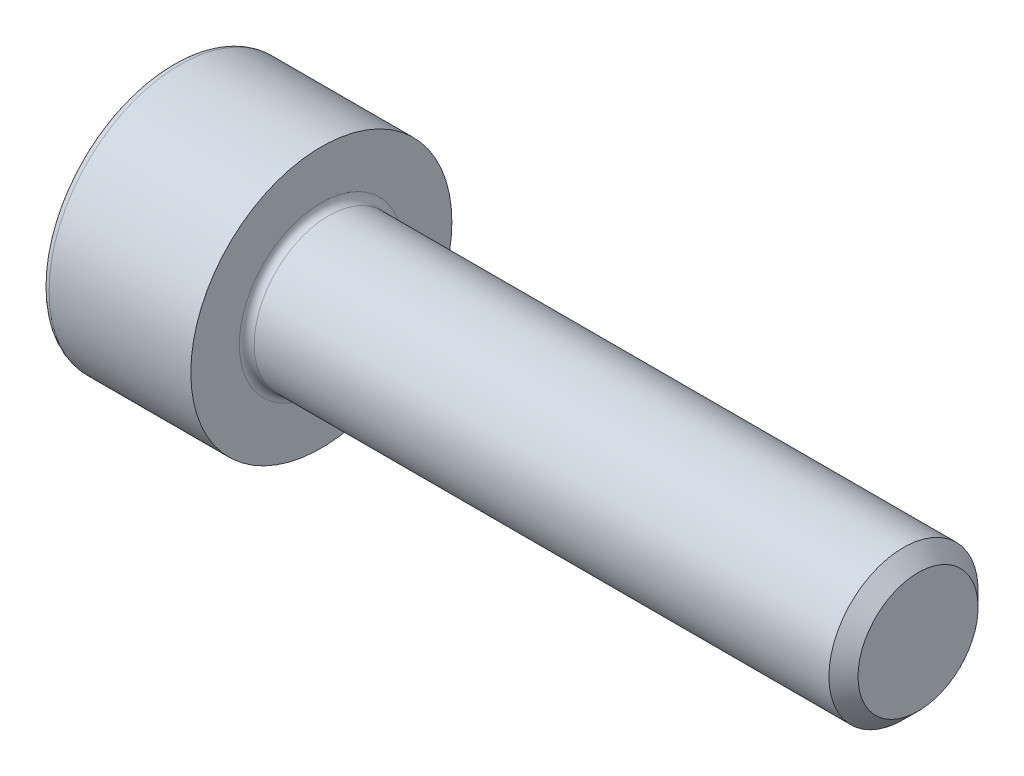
from build123d import *

# Parameters (mm, degrees)
FILLET1_R   = 0.2
FILLET2_R   = 0.2
HEX_2_DEPTH = 2


with BuildPart() as part:
    # BodySke → Base-Revolve (revolve)
    with BuildSketch(Plane.XY, mode=Mode.PRIVATE) as base_revolve_sk:
        Polygon((0, 0), (0, 3.5), (4, 3.5), (4, 2), (19.61, 2), (20, 1.61), (20, 0), align=None)
    revolve(base_revolve_sk.sketch.rotate(Axis((-31.75, 0, 0), (1, 0, 0)), 90), axis=Axis((-31.75, 0, 0), (1, 0, 0)))

    # Fillet1
    fillet1_edges = [part.edges().sort_by_distance(p)[0] for p in [
        (4, 0, -2),
    ]]
    fillet(fillet1_edges, radius=FILLET1_R)

    # Fillet2
    fillet2_edges = [part.edges().sort_by_distance(p)[0] for p in [
        (0, 0, -3.5),
    ]]
    fillet(fillet2_edges, radius=FILLET2_R)

    # Sketch2 → Hex-PreBroach (revolve, cut)
    with BuildSketch(Plane.XY, mode=Mode.PRIVATE) as hex_prebroach_sk:
        Polygon((0, 1.5355), (2, 1.5355), (2.886521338, 0), (0, 0), align=None)
    revolve(hex_prebroach_sk.sketch.rotate(Axis((0, 0, 0), (1, 0, 0)), 90), axis=Axis((0, 0, 0), (1, 0, 0)), mode=Mode.SUBTRACT)

    # Sketch3 → Hex 2 (cut)
    with BuildSketch(Plane(origin=(0, 0, 0), x_dir=(0, 0.500000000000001, 0.866025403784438), z_dir=(-1, 0, 0))):
        Polygon((0.886521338, 1.5355), (-0.886521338, 1.5355), (-1.773042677, 0), (-0.886521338, -1.5355), (0.886521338, -1.5355), (1.773042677, 0), align=None)
    extrude(amount=-HEX_2_DEPTH, mode=Mode.SUBTRACT)


solid = part.part
